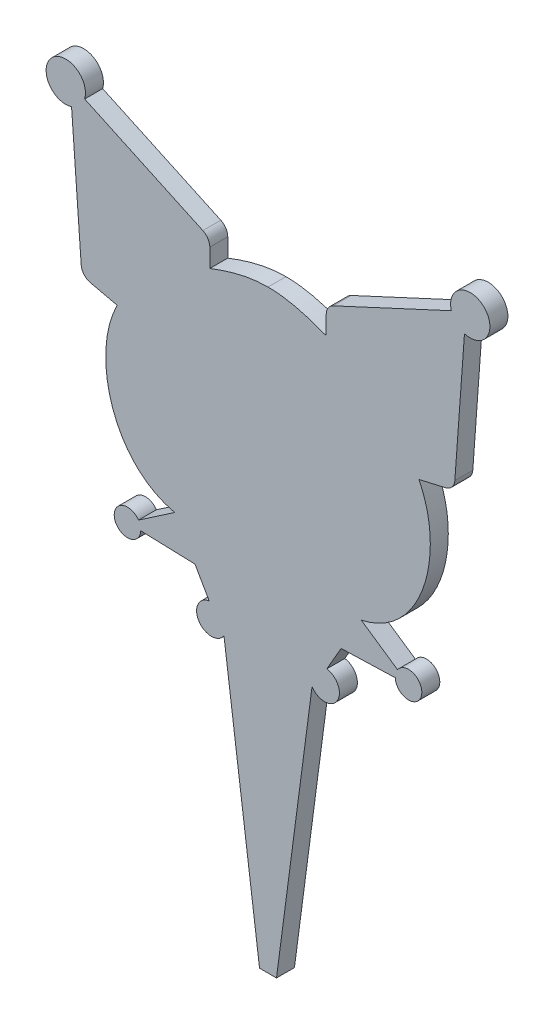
from build123d import *

# Parameters (mm, degrees)
BOSS_EXTRUDE1_DEPTH = 12
BOSS_EXTRUDE2_DEPTH = 12


with BuildPart() as part:
    # Sketch1 → Boss-Extrude1 (new body)
    with BuildSketch(Plane.XY):
        with BuildLine():
            Line((23.830196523, 277.926040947), (30.264697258, 189.690561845))
            ThreePointArc((30.264697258, 189.690561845), (32.171895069, 185.063236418), (36.455517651, 182.474777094))
            Line((36.455517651, 182.474777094), (54.309112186, 178.380959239))
            add(Edge.make_bspline(
                [(54.309112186, 178.380959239), (36.206087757, 143.483509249), (50.564037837, 86.913412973), (92.763702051, 77.806187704)],
                knots=[0, 0, 0, 0, 1, 1, 1, 1], degree=3))
            Line((92.763702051, 77.806187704), (68.493549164, 61.254957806))
            ThreePointArc((68.493549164, 61.254957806), (52.635787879, 53.842966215), (70.026657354, 55.833913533))
            Line((70.026657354, 55.833913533), (106.214537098, 54.688757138))
            Line((106.214537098, 54.688757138), (115.725037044, 38.136505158))
            ThreePointArc((115.725037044, 38.136505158), (114.407193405, 18.804958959), (123.920983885, 35.684922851))
            Line((123.920983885, 35.684922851), (155, 51.554338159))
            Line((155, 51.554338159), (186.079016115, 35.684922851))
            ThreePointArc((186.079016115, 35.684922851), (195.592806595, 18.804958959), (194.274962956, 38.136505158))
            Line((194.274962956, 38.136505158), (203.785462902, 54.688757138))
            Line((203.785462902, 54.688757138), (239.973342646, 55.833913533))
            ThreePointArc((239.973342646, 55.833913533), (257.364212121, 53.842966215), (241.506450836, 61.254957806))
            Line((241.506450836, 61.254957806), (217.236297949, 77.806187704))
            add(Edge.make_bspline(
                [(255.690887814, 178.380959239), (273.793912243, 143.483509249), (259.435962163, 86.913412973), (217.236297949, 77.806187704)],
                knots=[0, 0, 0, 0, 1, 1, 1, 1], degree=3))
            Line((255.690887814, 178.380959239), (273.544482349, 182.474777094))
            ThreePointArc((273.544482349, 182.474777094), (277.828104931, 185.063236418), (279.735302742, 189.690561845))
            Line((279.735302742, 189.690561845), (286.169803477, 277.926040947))
            ThreePointArc((286.169803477, 277.926040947), (299.376923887, 299.688458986), (277.421693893, 286.804408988))
            Line((277.421693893, 286.804408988), (198.503599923, 250.171277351))
            ThreePointArc((198.503599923, 250.171277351), (195.128538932, 247.219208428), (193.871929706, 242.914945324))
            Line((193.871929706, 242.914945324), (193.871929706, 230.573607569))
            add(Edge.make_bspline(
                [(193.871929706, 230.573607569), (181.465846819, 235.378509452), (168.531319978, 239.297450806), (155, 239.297450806)],
                knots=[0, 0, 0, 0, 1, 1, 1, 1], degree=3))
            add(Edge.make_bspline(
                [(116.128070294, 230.573607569), (128.534153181, 235.378509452), (141.468680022, 239.297450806), (155, 239.297450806)],
                knots=[0, 0, 0, 0, 1, 1, 1, 1], degree=3))
            Line((116.128070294, 230.573607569), (116.128070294, 242.914945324))
            ThreePointArc((116.128070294, 242.914945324), (114.871461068, 247.219208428), (111.496400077, 250.171277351))
            Line((111.496400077, 250.171277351), (32.578306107, 286.804408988))
            ThreePointArc((32.578306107, 286.804408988), (10.623076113, 299.688458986), (23.830196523, 277.926040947))
        make_face()
    extrude(amount=BOSS_EXTRUDE1_DEPTH)

    # Sketch2 → Boss-Extrude2 (add)
    with BuildSketch(Plane.XY.offset(12)):
        Polygon((123.920983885, 35.684922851), (149.345929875, -157.436715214), (160.654070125, -157.436715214), (186.079016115, 35.684922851), (155, 71.126323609), align=None)
    extrude(amount=-BOSS_EXTRUDE2_DEPTH)


solid = part.part
